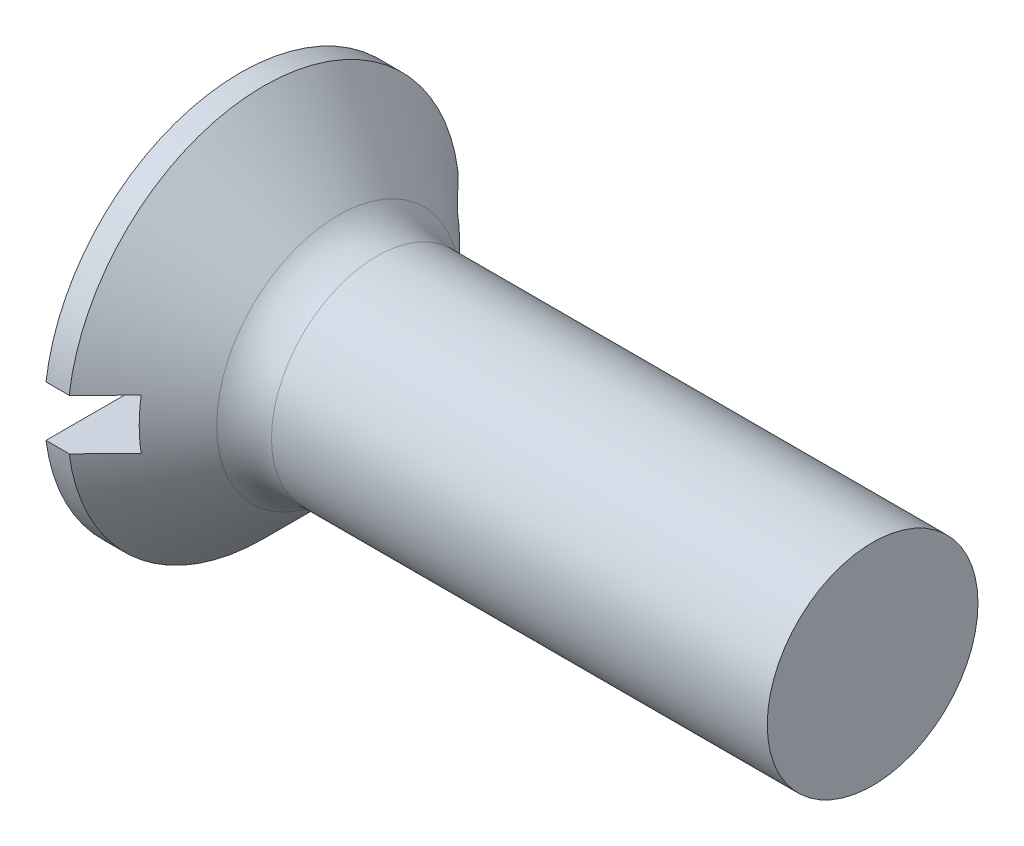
ISO-10303-21;
HEADER;
FILE_DESCRIPTION(('STEP AP214'),'2;1');
FILE_NAME('part.step','',(''),(''),'','','');
FILE_SCHEMA(('AUTOMOTIVE_DESIGN { 1 0 10303 214 1 1 1 1 }'));
ENDSEC;
DATA;
#1=APPLICATION_CONTEXT('core data for automotive mechanical design processes');
#2=APPLICATION_PROTOCOL_DEFINITION('international standard','automotive_design',2000,#1);
#3=PRODUCT_CONTEXT('',#1,'mechanical');
#4=PRODUCT('Part','Part','',(#3));
#5=PRODUCT_RELATED_PRODUCT_CATEGORY('part','',(#4));
#6=PRODUCT_DEFINITION_FORMATION('','',#4);
#7=PRODUCT_DEFINITION_CONTEXT('part definition',#1,'design');
#8=PRODUCT_DEFINITION('design','',#6,#7);
#9=PRODUCT_DEFINITION_SHAPE('','',#8);
#10=(LENGTH_UNIT() NAMED_UNIT(*) SI_UNIT(.MILLI.,.METRE.));
#11=(NAMED_UNIT(*) PLANE_ANGLE_UNIT() SI_UNIT($,.RADIAN.));
#12=(NAMED_UNIT(*) SI_UNIT($,.STERADIAN.) SOLID_ANGLE_UNIT());
#13=UNCERTAINTY_MEASURE_WITH_UNIT(LENGTH_MEASURE(1.E-05),#10,'distance_accuracy_value','');
#14=(GEOMETRIC_REPRESENTATION_CONTEXT(3) GLOBAL_UNCERTAINTY_ASSIGNED_CONTEXT((#13)) GLOBAL_UNIT_ASSIGNED_CONTEXT((#10,
#11,#12)) REPRESENTATION_CONTEXT('',''));
#15=CARTESIAN_POINT('',(0.,0.,0.));
#16=DIRECTION('',(0.,0.,1.));
#17=DIRECTION('',(1.,0.,0.));
#18=AXIS2_PLACEMENT_3D('',#15,#16,#17);
#19=CARTESIAN_POINT('',(0.,0.,0.));
#20=DIRECTION('',(-1.,0.,0.));
#21=DIRECTION('',(0.,0.,1.));
#22=AXIS2_PLACEMENT_3D('',#19,#20,#21);
#23=PLANE('',#22);
#24=DIRECTION('',(0.,0.,-1.));
#25=VECTOR('',#24,1.);
#26=CARTESIAN_POINT('',(0.,0.600000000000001,4.65));
#27=LINE('',#26,#25);
#28=CARTESIAN_POINT('',(0.,0.600000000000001,4.61112784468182));
#29=VERTEX_POINT('',#28);
#30=CARTESIAN_POINT('',(0.,0.599999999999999,-4.61112784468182));
#31=VERTEX_POINT('',#30);
#32=EDGE_CURVE('E169',#29,#31,#27,.T.);
#33=ORIENTED_EDGE('',*,*,#32,.F.);
#34=CARTESIAN_POINT('',(0.,0.,0.));
#35=DIRECTION('',(-1.,0.,0.));
#36=DIRECTION('',(0.,0.,1.));
#37=AXIS2_PLACEMENT_3D('',#34,#35,#36);
#38=CIRCLE('',#37,4.65);
#39=EDGE_CURVE('E113',#29,#31,#38,.T.);
#40=ORIENTED_EDGE('',*,*,#39,.T.);
#41=EDGE_LOOP('',(#33,#40));
#42=FACE_BOUND('',#41,.T.);
#43=ADVANCED_FACE('F32',(#42),#23,.T.);
#44=CARTESIAN_POINT('',(-6.34999999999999,0.,0.));
#45=DIRECTION('',(-1.,0.,0.));
#46=DIRECTION('',(0.,0.,1.));
#47=AXIS2_PLACEMENT_3D('',#44,#45,#46);
#48=CYLINDRICAL_SURFACE('',#47,4.65);
#49=DIRECTION('',(-1.,0.,0.));
#50=VECTOR('',#49,1.);
#51=CARTESIAN_POINT('',(-6.34999999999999,0.599999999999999,-4.61112784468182));
#52=LINE('',#51,#50);
#53=CARTESIAN_POINT('',(0.550000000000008,0.599999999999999,-4.61112784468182));
#54=VERTEX_POINT('',#53);
#55=EDGE_CURVE('E60',#31,#54,#52,.F.);
#56=ORIENTED_EDGE('',*,*,#55,.F.);
#57=ORIENTED_EDGE('',*,*,#39,.F.);
#58=DIRECTION('',(-1.,0.,0.));
#59=VECTOR('',#58,1.);
#60=CARTESIAN_POINT('',(-6.34999999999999,0.600000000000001,4.61112784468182));
#61=LINE('',#60,#59);
#62=CARTESIAN_POINT('',(0.550000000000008,0.600000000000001,4.61112784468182));
#63=VERTEX_POINT('',#62);
#64=EDGE_CURVE('E175',#63,#29,#61,.T.);
#65=ORIENTED_EDGE('',*,*,#64,.F.);
#66=CARTESIAN_POINT('',(0.550000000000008,0.,0.));
#67=DIRECTION('',(-1.,0.,0.));
#68=DIRECTION('',(0.,0.,1.));
#69=AXIS2_PLACEMENT_3D('',#66,#67,#68);
#70=CIRCLE('',#69,4.65);
#71=EDGE_CURVE('E107',#63,#54,#70,.T.);
#72=ORIENTED_EDGE('',*,*,#71,.T.);
#73=EDGE_LOOP('',(#56,#57,#65,#72));
#74=FACE_BOUND('',#73,.T.);
#75=ADVANCED_FACE('F153',(#74),#48,.T.);
#76=DIRECTION('',(0.,0.,1.));
#77=VECTOR('',#76,1.);
#78=CARTESIAN_POINT('',(0.,-0.600000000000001,-4.65));
#79=LINE('',#78,#77);
#80=CARTESIAN_POINT('',(0.,-0.600000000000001,-4.61112784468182));
#81=VERTEX_POINT('',#80);
#82=CARTESIAN_POINT('',(0.,-0.600000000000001,4.61112784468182));
#83=VERTEX_POINT('',#82);
#84=EDGE_CURVE('E101',#81,#83,#79,.T.);
#85=ORIENTED_EDGE('',*,*,#84,.F.);
#86=EDGE_CURVE('E109',#81,#83,#38,.T.);
#87=ORIENTED_EDGE('',*,*,#86,.T.);
#88=EDGE_LOOP('',(#85,#87));
#89=FACE_BOUND('',#88,.T.);
#90=ADVANCED_FACE('F155',(#89),#23,.T.);
#91=DIRECTION('',(-1.,0.,0.));
#92=VECTOR('',#91,1.);
#93=CARTESIAN_POINT('',(-6.34999999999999,-0.600000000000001,4.61112784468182));
#94=LINE('',#93,#92);
#95=CARTESIAN_POINT('',(0.550000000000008,-0.600000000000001,4.61112784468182));
#96=VERTEX_POINT('',#95);
#97=EDGE_CURVE('E174',#83,#96,#94,.F.);
#98=ORIENTED_EDGE('',*,*,#97,.F.);
#99=ORIENTED_EDGE('',*,*,#86,.F.);
#100=DIRECTION('',(-1.,0.,0.));
#101=VECTOR('',#100,1.);
#102=CARTESIAN_POINT('',(-6.34999999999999,-0.600000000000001,-4.61112784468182));
#103=LINE('',#102,#101);
#104=CARTESIAN_POINT('',(0.550000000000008,-0.600000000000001,-4.61112784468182));
#105=VERTEX_POINT('',#104);
#106=EDGE_CURVE('E172',#105,#81,#103,.T.);
#107=ORIENTED_EDGE('',*,*,#106,.F.);
#108=EDGE_CURVE('E110',#105,#96,#70,.T.);
#109=ORIENTED_EDGE('',*,*,#108,.T.);
#110=EDGE_LOOP('',(#98,#99,#107,#109));
#111=FACE_BOUND('',#110,.T.);
#112=ADVANCED_FACE('F150',(#111),#48,.T.);
#113=CARTESIAN_POINT('',(0.550000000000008,0.,0.));
#114=DIRECTION('',(-1.,0.,0.));
#115=DIRECTION('',(0.,0.,1.));
#116=AXIS2_PLACEMENT_3D('',#113,#114,#115);
#117=CONICAL_SURFACE('',#116,4.65,0.78539816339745);
#118=CARTESIAN_POINT('',(-5.05345798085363,0.599999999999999,-10.2358878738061));
#119=CARTESIAN_POINT('',(-4.7063338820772,0.599999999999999,-9.88816346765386));
#120=CARTESIAN_POINT('',(-4.35923588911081,0.599999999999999,-9.54041298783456));
#121=CARTESIAN_POINT('',(-3.66512028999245,0.599999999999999,-8.84482295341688));
#122=CARTESIAN_POINT('',(-3.31810268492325,0.599999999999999,-8.49698339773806));
#123=CARTESIAN_POINT('',(-2.6240861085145,0.599999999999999,-7.80108810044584));
#124=CARTESIAN_POINT('',(-2.27708717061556,0.599999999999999,-7.45303232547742));
#125=CARTESIAN_POINT('',(-1.58327190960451,0.599999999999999,-6.75674744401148));
#126=CARTESIAN_POINT('',(-1.23645558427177,0.599999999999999,-6.40851833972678));
#127=CARTESIAN_POINT('',(-0.530234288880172,0.599999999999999,-5.69884909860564));
#128=CARTESIAN_POINT('',(-0.170839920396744,0.599999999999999,-5.3373984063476));
#129=CARTESIAN_POINT('',(0.367846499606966,0.599999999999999,-4.79480605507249));
#130=CARTESIAN_POINT('',(0.547344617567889,0.599999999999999,-4.61386901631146));
#131=CARTESIAN_POINT('',(0.906142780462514,0.599999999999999,-4.251800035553));
#132=CARTESIAN_POINT('',(1.08544282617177,0.6,-4.07066809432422));
#133=CARTESIAN_POINT('',(1.44372217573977,0.6,-3.70815209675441));
#134=CARTESIAN_POINT('',(1.62270153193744,0.6,-3.52676809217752));
#135=CARTESIAN_POINT('',(1.98021132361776,0.6,-3.16355280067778));
#136=CARTESIAN_POINT('',(2.1587417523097,0.6,-2.98172150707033));
#137=CARTESIAN_POINT('',(2.51504600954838,0.6,-2.61734150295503));
#138=CARTESIAN_POINT('',(2.69281988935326,0.6,-2.43479284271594));
#139=CARTESIAN_POINT('',(2.95840184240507,0.6,-2.15993102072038));
#140=CARTESIAN_POINT('',(3.0467482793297,0.6,-2.06813839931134));
#141=CARTESIAN_POINT('',(3.22290791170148,0.6,-1.8840432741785));
#142=CARTESIAN_POINT('',(3.31072111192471,0.6,-1.79174077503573));
#143=CARTESIAN_POINT('',(3.44507973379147,0.6,-1.64924720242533));
#144=CARTESIAN_POINT('',(3.49191887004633,0.6,-1.59933324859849));
#145=CARTESIAN_POINT('',(3.58528403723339,0.6,-1.49921165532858));
#146=CARTESIAN_POINT('',(3.63181006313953,0.6,-1.44900401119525));
#147=CARTESIAN_POINT('',(3.72427703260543,0.6,-1.348388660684));
#148=CARTESIAN_POINT('',(3.77021949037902,0.6,-1.29798234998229));
#149=CARTESIAN_POINT('',(3.86152904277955,0.6,-1.19665513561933));
#150=CARTESIAN_POINT('',(3.90689615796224,0.6,-1.1457342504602));
#151=CARTESIAN_POINT('',(4.01209252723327,0.6,-1.02578570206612));
#152=CARTESIAN_POINT('',(4.07160553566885,0.6,-0.956477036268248));
#153=CARTESIAN_POINT('',(4.15917887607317,0.6,-0.850702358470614));
#154=CARTESIAN_POINT('',(4.18818199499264,0.6,-0.815019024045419));
#155=CARTESIAN_POINT('',(4.24528795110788,0.6,-0.742941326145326));
#156=CARTESIAN_POINT('',(4.27339088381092,0.6,-0.706547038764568));
#157=CARTESIAN_POINT('',(4.32869682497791,0.6,-0.632291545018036));
#158=CARTESIAN_POINT('',(4.35588213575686,0.6,-0.594417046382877));
#159=CARTESIAN_POINT('',(4.40832254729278,0.6,-0.517260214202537));
#160=CARTESIAN_POINT('',(4.43357498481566,0.6,-0.477976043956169));
#161=CARTESIAN_POINT('',(4.48075024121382,0.6,-0.397940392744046));
#162=CARTESIAN_POINT('',(4.50270366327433,0.6,-0.357207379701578));
#163=CARTESIAN_POINT('',(4.54164745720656,0.6,-0.273493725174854));
#164=CARTESIAN_POINT('',(4.55865364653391,0.6,-0.230520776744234));
#165=CARTESIAN_POINT('',(4.58372379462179,0.6,-0.145820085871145));
#166=CARTESIAN_POINT('',(4.59242377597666,0.6,-0.104295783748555));
#167=CARTESIAN_POINT('',(4.59893532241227,0.6,-0.0414391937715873));
#168=CARTESIAN_POINT('',(4.60002000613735,0.6,-0.0204304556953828));
#169=CARTESIAN_POINT('',(4.59997943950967,0.6,0.0215839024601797));
#170=CARTESIAN_POINT('',(4.59885411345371,0.6,0.0425895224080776));
#171=CARTESIAN_POINT('',(4.59227145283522,0.6,0.10501520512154));
#172=CARTESIAN_POINT('',(4.58363501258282,0.6,0.1461245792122));
#173=CARTESIAN_POINT('',(4.565808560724,0.6,0.206345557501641));
#174=CARTESIAN_POINT('',(4.55901965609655,0.6,0.226250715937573));
#175=CARTESIAN_POINT('',(4.54410905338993,0.6,0.265557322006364));
#176=CARTESIAN_POINT('',(4.53598757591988,0.6,0.284958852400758));
#177=CARTESIAN_POINT('',(4.51162458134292,0.6,0.33886087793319));
#178=CARTESIAN_POINT('',(4.49415337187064,0.6,0.372800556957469));
#179=CARTESIAN_POINT('',(4.45684225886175,0.6,0.439365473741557));
#180=CARTESIAN_POINT('',(4.436999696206,0.6,0.471989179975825));
#181=CARTESIAN_POINT('',(4.39563171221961,0.6,0.53629862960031));
#182=CARTESIAN_POINT('',(4.37410080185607,0.6,0.567980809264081));
#183=CARTESIAN_POINT('',(4.32989042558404,0.6,0.630537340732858));
#184=CARTESIAN_POINT('',(4.30721068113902,0.6,0.661411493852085));
#185=CARTESIAN_POINT('',(4.23751211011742,0.6,0.753681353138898));
#186=CARTESIAN_POINT('',(4.18923822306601,0.6,0.814124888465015));
#187=CARTESIAN_POINT('',(4.0909576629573,0.6,0.933321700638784));
#188=CARTESIAN_POINT('',(4.04095530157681,0.6,0.992078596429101));
#189=CARTESIAN_POINT('',(3.94086297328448,0.6,1.10735067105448));
#190=CARTESIAN_POINT('',(3.89079728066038,0.6,1.16388697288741));
#191=CARTESIAN_POINT('',(3.78992367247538,0.6,1.27629304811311));
#192=CARTESIAN_POINT('',(3.73911573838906,0.6,1.33216280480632));
#193=CARTESIAN_POINT('',(3.58591315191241,0.6,1.49908452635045));
#194=CARTESIAN_POINT('',(3.4827535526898,0.6,1.609433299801));
#195=CARTESIAN_POINT('',(3.27521830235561,0.6,1.82922471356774));
#196=CARTESIAN_POINT('',(3.17084134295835,0.6,1.93866611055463));
#197=CARTESIAN_POINT('',(2.96141984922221,0.6,2.15689179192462));
#198=CARTESIAN_POINT('',(2.85637536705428,0.6,2.26567612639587));
#199=CARTESIAN_POINT('',(2.64692360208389,0.6,2.481710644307));
#200=CARTESIAN_POINT('',(2.5425207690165,0.6,2.58896514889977));
#201=CARTESIAN_POINT('',(2.33341496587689,0.6,2.80318525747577));
#202=CARTESIAN_POINT('',(2.22871198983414,0.6,2.91015085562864));
#203=CARTESIAN_POINT('',(1.91438863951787,0.6,3.23063427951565));
#204=CARTESIAN_POINT('',(1.70445280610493,0.6,3.44384256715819));
#205=CARTESIAN_POINT('',(1.22510768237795,0.6,3.9295930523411));
#206=CARTESIAN_POINT('',(0.955548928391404,0.600000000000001,4.20198758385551));
#207=CARTESIAN_POINT('',(0.416004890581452,0.600000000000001,4.74635530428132));
#208=CARTESIAN_POINT('',(0.146019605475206,0.600000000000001,5.01832849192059));
#209=CARTESIAN_POINT('',(-0.664426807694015,0.600000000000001,5.83398149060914));
#210=CARTESIAN_POINT('',(-1.2052682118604,0.600000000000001,6.37728333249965));
#211=CARTESIAN_POINT('',(-2.297244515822,0.600000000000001,7.47334328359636));
#212=CARTESIAN_POINT('',(-2.84838746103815,0.600000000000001,8.02609337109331));
#213=CARTESIAN_POINT('',(-3.95082527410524,0.600000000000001,9.1312059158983));
#214=CARTESIAN_POINT('',(-4.5021200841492,0.600000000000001,9.683568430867));
#215=CARTESIAN_POINT('',(-5.05345798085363,0.600000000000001,10.2358878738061));
#216=B_SPLINE_CURVE_WITH_KNOTS('',3,(#118,#119,#120,#121,#122,#123,#124,#125,#126,#127,#128,
#129,#130,#131,#132,#133,#134,#135,#136,#137,#138,#139,#140,#141,#142,#143,#144,#145,#146,#147,
#148,#149,#150,#151,#152,#153,#154,#155,#156,#157,#158,#159,#160,#161,#162,#163,#164,#165,#166,
#167,#168,#169,#170,#171,#172,#173,#174,#175,#176,#177,#178,#179,#180,#181,#182,#183,#184,#185,
#186,#187,#188,#189,#190,#191,#192,#193,#194,#195,#196,#197,#198,#199,#200,#201,#202,#203,#204,
#205,#206,#207,#208,#209,#210,#211,#212,#213,#214,#215),.UNSPECIFIED.,.F.,.F.,(4,2,2,2,2,2,2,2,
2,2,2,2,2,2,2,2,2,2,2,2,2,2,2,2,2,2,2,2,2,2,2,2,2,2,2,2,2,2,2,2,2,2,2,2,2,2,2,2,4),(0.,
1.47399683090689,2.94801247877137,4.4224478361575,5.89686482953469,7.42601395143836,
8.19061836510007,8.95521977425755,9.71968231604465,10.4841563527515,11.2485777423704,
11.630779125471,12.0129770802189,12.2183239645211,12.4236741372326,12.6282760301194,
12.8328705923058,13.1068888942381,13.2448295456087,13.3827555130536,13.522578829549,
13.6625914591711,13.8012122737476,13.9393848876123,14.0658401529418,14.1288404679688,
14.1918429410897,14.3170190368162,14.3800826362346,14.4431358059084,14.557498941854,
14.6719915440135,14.7868731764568,14.9017827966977,15.1337679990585,15.365211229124,
15.5917537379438,15.8183019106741,16.2714608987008,16.7251625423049,17.1788291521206,
17.6278622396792,18.076904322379,18.9745538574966,20.1242253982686,21.2739004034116,
23.5737206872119,25.9154338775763,28.2566456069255),.UNSPECIFIED.);
#217=CARTESIAN_POINT('',(1.4,0.6,3.75233260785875));
#218=VERTEX_POINT('',#217);
#219=EDGE_CURVE('E11',#218,#63,#216,.T.);
#220=ORIENTED_EDGE('',*,*,#219,.F.);
#221=CARTESIAN_POINT('',(1.4,0.,0.));
#222=DIRECTION('',(1.,0.,0.));
#223=DIRECTION('',(0.,0.,-1.));
#224=AXIS2_PLACEMENT_3D('',#221,#222,#223);
#225=CIRCLE('',#224,3.80000000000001);
#226=CARTESIAN_POINT('',(1.4,-0.600000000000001,3.75233260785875));
#227=VERTEX_POINT('',#226);
#228=EDGE_CURVE('E89',#227,#218,#225,.F.);
#229=ORIENTED_EDGE('',*,*,#228,.F.);
#230=CARTESIAN_POINT('',(-5.05345798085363,-0.600000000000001,10.2358878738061));
#231=CARTESIAN_POINT('',(-4.7063338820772,-0.600000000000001,9.88816346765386));
#232=CARTESIAN_POINT('',(-4.35923588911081,-0.600000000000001,9.54041298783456));
#233=CARTESIAN_POINT('',(-3.66512028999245,-0.600000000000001,8.84482295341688));
#234=CARTESIAN_POINT('',(-3.31810268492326,-0.600000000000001,8.49698339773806));
#235=CARTESIAN_POINT('',(-2.6240861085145,-0.600000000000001,7.80108810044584));
#236=CARTESIAN_POINT('',(-2.27708717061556,-0.600000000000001,7.45303232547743));
#237=CARTESIAN_POINT('',(-1.58327190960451,-0.600000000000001,6.75674744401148));
#238=CARTESIAN_POINT('',(-1.23645558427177,-0.600000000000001,6.40851833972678));
#239=CARTESIAN_POINT('',(-0.530234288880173,-0.600000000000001,5.69884909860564));
#240=CARTESIAN_POINT('',(-0.170839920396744,-0.600000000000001,5.3373984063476));
#241=CARTESIAN_POINT('',(0.367846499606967,-0.600000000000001,4.79480605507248));
#242=CARTESIAN_POINT('',(0.547344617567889,-0.600000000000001,4.61386901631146));
#243=CARTESIAN_POINT('',(0.906142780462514,-0.600000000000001,4.251800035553));
#244=CARTESIAN_POINT('',(1.08544282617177,-0.600000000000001,4.07066809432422));
#245=CARTESIAN_POINT('',(1.44372217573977,-0.600000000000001,3.70815209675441));
#246=CARTESIAN_POINT('',(1.62270153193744,-0.600000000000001,3.52676809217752));
#247=CARTESIAN_POINT('',(1.98021132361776,-0.600000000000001,3.16355280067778));
#248=CARTESIAN_POINT('',(2.1587417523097,-0.600000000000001,2.98172150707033));
#249=CARTESIAN_POINT('',(2.51504600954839,-0.600000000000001,2.61734150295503));
#250=CARTESIAN_POINT('',(2.69281988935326,-0.600000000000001,2.43479284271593));
#251=CARTESIAN_POINT('',(2.95840184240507,-0.600000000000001,2.15993102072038));
#252=CARTESIAN_POINT('',(3.0467482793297,-0.600000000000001,2.06813839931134));
#253=CARTESIAN_POINT('',(3.22290791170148,-0.600000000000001,1.8840432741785));
#254=CARTESIAN_POINT('',(3.31072111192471,-0.600000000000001,1.79174077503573));
#255=CARTESIAN_POINT('',(3.44507973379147,-0.600000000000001,1.64924720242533));
#256=CARTESIAN_POINT('',(3.49191887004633,-0.600000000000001,1.59933324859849));
#257=CARTESIAN_POINT('',(3.58528403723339,-0.600000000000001,1.49921165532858));
#258=CARTESIAN_POINT('',(3.63181006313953,-0.600000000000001,1.44900401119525));
#259=CARTESIAN_POINT('',(3.72427703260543,-0.600000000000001,1.348388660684));
#260=CARTESIAN_POINT('',(3.77021949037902,-0.600000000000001,1.29798234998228));
#261=CARTESIAN_POINT('',(3.86152904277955,-0.600000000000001,1.19665513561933));
#262=CARTESIAN_POINT('',(3.90689615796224,-0.600000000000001,1.1457342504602));
#263=CARTESIAN_POINT('',(4.01209252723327,-0.600000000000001,1.02578570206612));
#264=CARTESIAN_POINT('',(4.07160553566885,-0.600000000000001,0.956477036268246));
#265=CARTESIAN_POINT('',(4.15917887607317,-0.600000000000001,0.850702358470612));
#266=CARTESIAN_POINT('',(4.18818199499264,-0.600000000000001,0.815019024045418));
#267=CARTESIAN_POINT('',(4.24528795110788,-0.600000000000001,0.742941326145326));
#268=CARTESIAN_POINT('',(4.27339088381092,-0.600000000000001,0.706547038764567));
#269=CARTESIAN_POINT('',(4.32869682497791,-0.600000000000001,0.632291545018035));
#270=CARTESIAN_POINT('',(4.35588213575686,-0.600000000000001,0.594417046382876));
#271=CARTESIAN_POINT('',(4.40832254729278,-0.600000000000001,0.517260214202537));
#272=CARTESIAN_POINT('',(4.43357498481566,-0.600000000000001,0.477976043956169));
#273=CARTESIAN_POINT('',(4.48075024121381,-0.600000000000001,0.397940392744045));
#274=CARTESIAN_POINT('',(4.50270366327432,-0.600000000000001,0.357207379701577));
#275=CARTESIAN_POINT('',(4.54164745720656,-0.600000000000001,0.273493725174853));
#276=CARTESIAN_POINT('',(4.55865364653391,-0.600000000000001,0.230520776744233));
#277=CARTESIAN_POINT('',(4.58372379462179,-0.600000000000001,0.145820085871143));
#278=CARTESIAN_POINT('',(4.59242377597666,-0.600000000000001,0.104295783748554));
#279=CARTESIAN_POINT('',(4.59893532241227,-0.600000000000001,0.0414391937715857));
#280=CARTESIAN_POINT('',(4.60002000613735,-0.600000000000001,0.0204304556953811));
#281=CARTESIAN_POINT('',(4.59997943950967,-0.600000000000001,-0.0215839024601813));
#282=CARTESIAN_POINT('',(4.59885411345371,-0.600000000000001,-0.0425895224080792));
#283=CARTESIAN_POINT('',(4.59227145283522,-0.600000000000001,-0.105015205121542));
#284=CARTESIAN_POINT('',(4.58363501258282,-0.600000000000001,-0.146124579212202));
#285=CARTESIAN_POINT('',(4.565808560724,-0.600000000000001,-0.206345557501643));
#286=CARTESIAN_POINT('',(4.55901965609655,-0.600000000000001,-0.226250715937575));
#287=CARTESIAN_POINT('',(4.54410905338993,-0.600000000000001,-0.265557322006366));
#288=CARTESIAN_POINT('',(4.53598757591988,-0.600000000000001,-0.284958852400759));
#289=CARTESIAN_POINT('',(4.51162458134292,-0.600000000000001,-0.338860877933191));
#290=CARTESIAN_POINT('',(4.49415337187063,-0.600000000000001,-0.37280055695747));
#291=CARTESIAN_POINT('',(4.45684225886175,-0.600000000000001,-0.439365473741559));
#292=CARTESIAN_POINT('',(4.43699969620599,-0.600000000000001,-0.471989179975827));
#293=CARTESIAN_POINT('',(4.3956317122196,-0.600000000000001,-0.536298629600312));
#294=CARTESIAN_POINT('',(4.37410080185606,-0.600000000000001,-0.567980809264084));
#295=CARTESIAN_POINT('',(4.32989042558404,-0.600000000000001,-0.630537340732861));
#296=CARTESIAN_POINT('',(4.30721068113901,-0.600000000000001,-0.661411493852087));
#297=CARTESIAN_POINT('',(4.23751211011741,-0.600000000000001,-0.753681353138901));
#298=CARTESIAN_POINT('',(4.18923822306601,-0.600000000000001,-0.814124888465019));
#299=CARTESIAN_POINT('',(4.09095766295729,-0.600000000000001,-0.933321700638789));
#300=CARTESIAN_POINT('',(4.04095530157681,-0.600000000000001,-0.992078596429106));
#301=CARTESIAN_POINT('',(3.94086297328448,-0.600000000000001,-1.10735067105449));
#302=CARTESIAN_POINT('',(3.89079728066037,-0.600000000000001,-1.16388697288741));
#303=CARTESIAN_POINT('',(3.78992367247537,-0.600000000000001,-1.27629304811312));
#304=CARTESIAN_POINT('',(3.73911573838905,-0.600000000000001,-1.33216280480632));
#305=CARTESIAN_POINT('',(3.5859131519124,-0.600000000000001,-1.49908452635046));
#306=CARTESIAN_POINT('',(3.48275355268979,-0.600000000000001,-1.60943329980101));
#307=CARTESIAN_POINT('',(3.2752183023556,-0.600000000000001,-1.82922471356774));
#308=CARTESIAN_POINT('',(3.17084134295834,-0.600000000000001,-1.93866611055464));
#309=CARTESIAN_POINT('',(2.9614198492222,-0.600000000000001,-2.15689179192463));
#310=CARTESIAN_POINT('',(2.85637536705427,-0.600000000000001,-2.26567612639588));
#311=CARTESIAN_POINT('',(2.64692360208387,-0.600000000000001,-2.48171064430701));
#312=CARTESIAN_POINT('',(2.54252076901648,-0.600000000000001,-2.58896514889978));
#313=CARTESIAN_POINT('',(2.33341496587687,-0.600000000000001,-2.80318525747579));
#314=CARTESIAN_POINT('',(2.22871198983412,-0.600000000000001,-2.91015085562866));
#315=CARTESIAN_POINT('',(1.91438863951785,-0.600000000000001,-3.23063427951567));
#316=CARTESIAN_POINT('',(1.70445280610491,-0.600000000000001,-3.44384256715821));
#317=CARTESIAN_POINT('',(1.22510768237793,-0.600000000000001,-3.92959305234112));
#318=CARTESIAN_POINT('',(0.955548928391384,-0.600000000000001,-4.20198758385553));
#319=CARTESIAN_POINT('',(0.416004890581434,-0.600000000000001,-4.74635530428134));
#320=CARTESIAN_POINT('',(0.146019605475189,-0.600000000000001,-5.01832849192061));
#321=CARTESIAN_POINT('',(-0.66442680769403,-0.600000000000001,-5.83398149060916));
#322=CARTESIAN_POINT('',(-1.20526821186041,-0.600000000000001,-6.37728333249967));
#323=CARTESIAN_POINT('',(-2.29724451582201,-0.600000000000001,-7.47334328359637));
#324=CARTESIAN_POINT('',(-2.84838746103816,-0.600000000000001,-8.02609337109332));
#325=CARTESIAN_POINT('',(-3.95082527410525,-0.600000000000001,-9.13120591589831));
#326=CARTESIAN_POINT('',(-4.5021200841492,-0.600000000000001,-9.68356843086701));
#327=CARTESIAN_POINT('',(-5.05345798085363,-0.600000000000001,-10.2358878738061));
#328=B_SPLINE_CURVE_WITH_KNOTS('',3,(#230,#231,#232,#233,#234,#235,#236,#237,#238,#239,#240,
#241,#242,#243,#244,#245,#246,#247,#248,#249,#250,#251,#252,#253,#254,#255,#256,#257,#258,#259,
#260,#261,#262,#263,#264,#265,#266,#267,#268,#269,#270,#271,#272,#273,#274,#275,#276,#277,#278,
#279,#280,#281,#282,#283,#284,#285,#286,#287,#288,#289,#290,#291,#292,#293,#294,#295,#296,#297,
#298,#299,#300,#301,#302,#303,#304,#305,#306,#307,#308,#309,#310,#311,#312,#313,#314,#315,#316,
#317,#318,#319,#320,#321,#322,#323,#324,#325,#326,#327),.UNSPECIFIED.,.F.,.F.,(4,2,2,2,2,2,2,2,
2,2,2,2,2,2,2,2,2,2,2,2,2,2,2,2,2,2,2,2,2,2,2,2,2,2,2,2,2,2,2,2,2,2,2,2,2,2,2,2,4),(0.,
1.47399683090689,2.94801247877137,4.4224478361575,5.89686482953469,7.42601395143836,
8.19061836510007,8.95521977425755,9.71968231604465,10.4841563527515,11.2485777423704,
11.630779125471,12.0129770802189,12.2183239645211,12.4236741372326,12.6282760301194,
12.8328705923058,13.1068888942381,13.2448295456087,13.3827555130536,13.522578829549,
13.6625914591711,13.8012122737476,13.9393848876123,14.0658401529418,14.1288404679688,
14.1918429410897,14.3170190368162,14.3800826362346,14.4431358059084,14.557498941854,
14.6719915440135,14.7868731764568,14.9017827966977,15.1337679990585,15.365211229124,
15.5917537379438,15.8183019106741,16.2714608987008,16.7251625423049,17.1788291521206,
17.6278622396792,18.076904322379,18.9745538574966,20.1242253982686,21.2739004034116,
23.5737206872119,25.9154338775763,28.2566456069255),.UNSPECIFIED.);
#329=EDGE_CURVE('E46',#96,#227,#328,.T.);
#330=ORIENTED_EDGE('',*,*,#329,.F.);
#331=ORIENTED_EDGE('',*,*,#108,.F.);
#332=CARTESIAN_POINT('',(1.4,-0.600000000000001,-3.75233260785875));
#333=VERTEX_POINT('',#332);
#334=EDGE_CURVE('E125',#333,#105,#328,.T.);
#335=ORIENTED_EDGE('',*,*,#334,.F.);
#336=CARTESIAN_POINT('',(1.4,0.6,-3.75233260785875));
#337=VERTEX_POINT('',#336);
#338=EDGE_CURVE('E97',#337,#333,#225,.F.);
#339=ORIENTED_EDGE('',*,*,#338,.F.);
#340=EDGE_CURVE('E36',#54,#337,#216,.T.);
#341=ORIENTED_EDGE('',*,*,#340,.F.);
#342=ORIENTED_EDGE('',*,*,#71,.F.);
#343=EDGE_LOOP('',(#220,#229,#330,#331,#335,#339,#341,#342));
#344=FACE_BOUND('',#343,.T.);
#345=CARTESIAN_POINT('',(2.31923881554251,0.,0.));
#346=DIRECTION('',(-1.,0.,0.));
#347=DIRECTION('',(0.,0.,1.));
#348=AXIS2_PLACEMENT_3D('',#345,#346,#347);
#349=CIRCLE('',#348,2.88076118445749);
#350=CARTESIAN_POINT('',(2.31923881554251,0.,2.88076118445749));
#351=VERTEX_POINT('',#350);
#352=EDGE_CURVE('E120',#351,#351,#349,.T.);
#353=ORIENTED_EDGE('',*,*,#352,.T.);
#354=EDGE_LOOP('',(#353));
#355=FACE_BOUND('',#354,.T.);
#356=ADVANCED_FACE('F104',(#344,#355),#117,.T.);
#357=CARTESIAN_POINT('',(-6.34999999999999,0.,0.));
#358=DIRECTION('',(-1.,0.,0.));
#359=DIRECTION('',(0.,0.,1.));
#360=AXIS2_PLACEMENT_3D('',#357,#358,#359);
#361=CYLINDRICAL_SURFACE('',#360,2.5);
#362=CARTESIAN_POINT('',(3.23847763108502,0.,0.));
#363=DIRECTION('',(-1.,0.,0.));
#364=DIRECTION('',(0.,0.,1.));
#365=AXIS2_PLACEMENT_3D('',#362,#363,#364);
#366=CIRCLE('',#365,2.5);
#367=CARTESIAN_POINT('',(3.23847763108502,0.,2.5));
#368=VERTEX_POINT('',#367);
#369=EDGE_CURVE('E123',#368,#368,#366,.F.);
#370=ORIENTED_EDGE('',*,*,#369,.T.);
#371=EDGE_LOOP('',(#370));
#372=FACE_BOUND('',#371,.T.);
#373=CARTESIAN_POINT('',(15.,0.,0.));
#374=DIRECTION('',(-1.,0.,0.));
#375=DIRECTION('',(0.,0.,1.));
#376=AXIS2_PLACEMENT_3D('',#373,#374,#375);
#377=CIRCLE('',#376,2.5);
#378=CARTESIAN_POINT('',(15.,0.,2.5));
#379=VERTEX_POINT('',#378);
#380=EDGE_CURVE('E116',#379,#379,#377,.T.);
#381=ORIENTED_EDGE('',*,*,#380,.T.);
#382=EDGE_LOOP('',(#381));
#383=FACE_BOUND('',#382,.T.);
#384=ADVANCED_FACE('F143',(#372,#383),#361,.T.);
#385=CARTESIAN_POINT('',(15.,2.5,0.));
#386=DIRECTION('',(1.,0.,0.));
#387=DIRECTION('',(0.,0.,-1.));
#388=AXIS2_PLACEMENT_3D('',#385,#386,#387);
#389=PLANE('',#388);
#390=ORIENTED_EDGE('',*,*,#380,.F.);
#391=EDGE_LOOP('',(#390));
#392=FACE_BOUND('',#391,.T.);
#393=ADVANCED_FACE('F141',(#392),#389,.T.);
#394=CARTESIAN_POINT('',(3.23847763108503,0.,0.));
#395=DIRECTION('',(-1.,0.,0.));
#396=DIRECTION('',(0.,0.,1.));
#397=AXIS2_PLACEMENT_3D('',#394,#395,#396);
#398=TOROIDAL_SURFACE('',#397,3.8,1.3);
#399=ORIENTED_EDGE('',*,*,#369,.F.);
#400=EDGE_LOOP('',(#399));
#401=FACE_BOUND('',#400,.T.);
#402=ORIENTED_EDGE('',*,*,#352,.F.);
#403=EDGE_LOOP('',(#402));
#404=FACE_BOUND('',#403,.T.);
#405=ADVANCED_FACE('F34',(#401,#404),#398,.F.);
#406=CARTESIAN_POINT('',(1.4,0.600000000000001,4.65));
#407=DIRECTION('',(0.,1.,0.));
#408=DIRECTION('',(0.,0.,1.));
#409=AXIS2_PLACEMENT_3D('',#406,#407,#408);
#410=PLANE('',#409);
#411=ORIENTED_EDGE('',*,*,#55,.T.);
#412=ORIENTED_EDGE('',*,*,#340,.T.);
#413=DIRECTION('',(0.,0.,-1.));
#414=VECTOR('',#413,1.);
#415=CARTESIAN_POINT('',(1.4,0.600000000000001,4.65));
#416=LINE('',#415,#414);
#417=EDGE_CURVE('E53',#218,#337,#416,.T.);
#418=ORIENTED_EDGE('',*,*,#417,.F.);
#419=ORIENTED_EDGE('',*,*,#219,.T.);
#420=ORIENTED_EDGE('',*,*,#64,.T.);
#421=ORIENTED_EDGE('',*,*,#32,.T.);
#422=EDGE_LOOP('',(#411,#412,#418,#419,#420,#421));
#423=FACE_BOUND('',#422,.T.);
#424=ADVANCED_FACE('F98',(#423),#410,.F.);
#425=CARTESIAN_POINT('',(1.4,-0.600000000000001,-4.65));
#426=DIRECTION('',(0.,-1.,0.));
#427=DIRECTION('',(0.,0.,-1.));
#428=AXIS2_PLACEMENT_3D('',#425,#426,#427);
#429=PLANE('',#428);
#430=ORIENTED_EDGE('',*,*,#97,.T.);
#431=ORIENTED_EDGE('',*,*,#329,.T.);
#432=DIRECTION('',(0.,0.,1.));
#433=VECTOR('',#432,1.);
#434=CARTESIAN_POINT('',(1.4,-0.600000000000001,-4.65));
#435=LINE('',#434,#433);
#436=EDGE_CURVE('E92',#333,#227,#435,.T.);
#437=ORIENTED_EDGE('',*,*,#436,.F.);
#438=ORIENTED_EDGE('',*,*,#334,.T.);
#439=ORIENTED_EDGE('',*,*,#106,.T.);
#440=ORIENTED_EDGE('',*,*,#84,.T.);
#441=EDGE_LOOP('',(#430,#431,#437,#438,#439,#440));
#442=FACE_BOUND('',#441,.T.);
#443=ADVANCED_FACE('F133',(#442),#429,.F.);
#444=CARTESIAN_POINT('',(1.4,-0.600000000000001,-4.65));
#445=DIRECTION('',(1.,0.,0.));
#446=DIRECTION('',(0.,0.,-1.));
#447=AXIS2_PLACEMENT_3D('',#444,#445,#446);
#448=PLANE('',#447);
#449=ORIENTED_EDGE('',*,*,#228,.T.);
#450=ORIENTED_EDGE('',*,*,#417,.T.);
#451=ORIENTED_EDGE('',*,*,#338,.T.);
#452=ORIENTED_EDGE('',*,*,#436,.T.);
#453=EDGE_LOOP('',(#449,#450,#451,#452));
#454=FACE_BOUND('',#453,.T.);
#455=ADVANCED_FACE('F90',(#454),#448,.F.);
#456=CLOSED_SHELL('',(#43,#75,#90,#112,#356,#384,#393,#405,#424,#443,#455));
#457=MANIFOLD_SOLID_BREP('B2',#456);
#458=ADVANCED_BREP_SHAPE_REPRESENTATION('',(#18,#457),#14);
#459=SHAPE_DEFINITION_REPRESENTATION(#9,#458);
ENDSEC;
END-ISO-10303-21;
